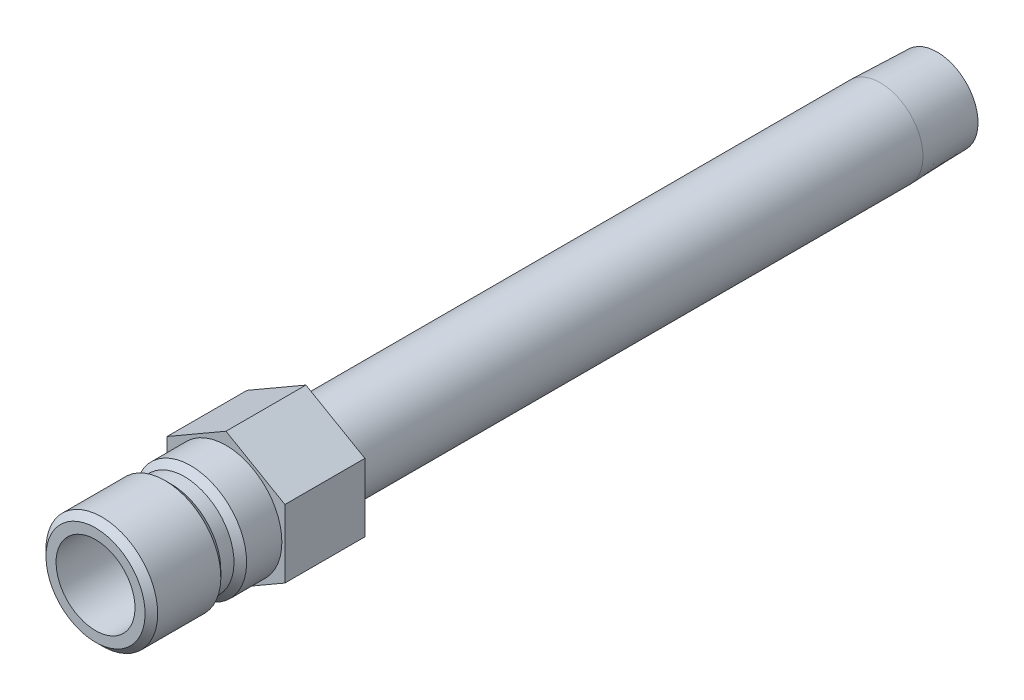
ISO-10303-21;
HEADER;
FILE_DESCRIPTION(('STEP AP214'),'2;1');
FILE_NAME('part.step','',(''),(''),'','','');
FILE_SCHEMA(('AUTOMOTIVE_DESIGN { 1 0 10303 214 1 1 1 1 }'));
ENDSEC;
DATA;
#1=APPLICATION_CONTEXT('core data for automotive mechanical design processes');
#2=APPLICATION_PROTOCOL_DEFINITION('international standard','automotive_design',2000,#1);
#3=PRODUCT_CONTEXT('',#1,'mechanical');
#4=PRODUCT('Part','Part','',(#3));
#5=PRODUCT_RELATED_PRODUCT_CATEGORY('part','',(#4));
#6=PRODUCT_DEFINITION_FORMATION('','',#4);
#7=PRODUCT_DEFINITION_CONTEXT('part definition',#1,'design');
#8=PRODUCT_DEFINITION('design','',#6,#7);
#9=PRODUCT_DEFINITION_SHAPE('','',#8);
#10=(LENGTH_UNIT() NAMED_UNIT(*) SI_UNIT(.MILLI.,.METRE.));
#11=(NAMED_UNIT(*) PLANE_ANGLE_UNIT() SI_UNIT($,.RADIAN.));
#12=(NAMED_UNIT(*) SI_UNIT($,.STERADIAN.) SOLID_ANGLE_UNIT());
#13=UNCERTAINTY_MEASURE_WITH_UNIT(LENGTH_MEASURE(1.E-05),#10,'distance_accuracy_value','');
#14=(GEOMETRIC_REPRESENTATION_CONTEXT(3) GLOBAL_UNCERTAINTY_ASSIGNED_CONTEXT((#13)) GLOBAL_UNIT_ASSIGNED_CONTEXT((#10,
#11,#12)) REPRESENTATION_CONTEXT('',''));
#15=CARTESIAN_POINT('',(0.,0.,0.));
#16=DIRECTION('',(0.,0.,1.));
#17=DIRECTION('',(1.,0.,0.));
#18=AXIS2_PLACEMENT_3D('',#15,#16,#17);
#19=CARTESIAN_POINT('',(0.,0.,-9.652));
#20=DIRECTION('',(0.,0.,-1.));
#21=DIRECTION('',(0.,1.,0.));
#22=AXIS2_PLACEMENT_3D('',#19,#20,#21);
#23=CYLINDRICAL_SURFACE('',#22,4.7625);
#24=CARTESIAN_POINT('',(0.,0.,3.556));
#25=DIRECTION('',(0.,0.,-1.));
#26=DIRECTION('',(0.,1.,0.));
#27=AXIS2_PLACEMENT_3D('',#24,#25,#26);
#28=CIRCLE('',#27,4.7625);
#29=CARTESIAN_POINT('',(0.,4.7625,3.556));
#30=VERTEX_POINT('',#29);
#31=EDGE_CURVE('E137',#30,#30,#28,.T.);
#32=ORIENTED_EDGE('',*,*,#31,.T.);
#33=EDGE_LOOP('',(#32));
#34=FACE_BOUND('',#33,.T.);
#35=CARTESIAN_POINT('',(0.,0.,15.748));
#36=DIRECTION('',(0.,0.,-1.));
#37=DIRECTION('',(0.,1.,0.));
#38=AXIS2_PLACEMENT_3D('',#35,#36,#37);
#39=CIRCLE('',#38,4.7625);
#40=CARTESIAN_POINT('',(0.,4.7625,15.748));
#41=VERTEX_POINT('',#40);
#42=EDGE_CURVE('E41',#41,#41,#39,.T.);
#43=ORIENTED_EDGE('',*,*,#42,.F.);
#44=EDGE_LOOP('',(#43));
#45=FACE_BOUND('',#44,.T.);
#46=ADVANCED_FACE('F33',(#34,#45),#23,.F.);
#47=CARTESIAN_POINT('',(0.,4.7625,15.748));
#48=DIRECTION('',(0.,0.,1.));
#49=DIRECTION('',(0.,-1.,0.));
#50=AXIS2_PLACEMENT_3D('',#47,#48,#49);
#51=PLANE('',#50);
#52=ORIENTED_EDGE('',*,*,#42,.T.);
#53=EDGE_LOOP('',(#52));
#54=FACE_BOUND('',#53,.T.);
#55=CARTESIAN_POINT('',(0.,0.,15.748));
#56=DIRECTION('',(0.,0.,-1.));
#57=DIRECTION('',(0.,1.,0.));
#58=AXIS2_PLACEMENT_3D('',#55,#56,#57);
#59=CIRCLE('',#58,5.9817);
#60=CARTESIAN_POINT('',(0.,5.9817,15.748));
#61=VERTEX_POINT('',#60);
#62=EDGE_CURVE('E175',#61,#61,#59,.T.);
#63=ORIENTED_EDGE('',*,*,#62,.F.);
#64=EDGE_LOOP('',(#63));
#65=FACE_BOUND('',#64,.T.);
#66=ADVANCED_FACE('F180',(#54,#65),#51,.T.);
#67=CARTESIAN_POINT('',(0.,0.,14.986));
#68=DIRECTION('',(0.,0.,-1.));
#69=DIRECTION('',(0.,1.,0.));
#70=AXIS2_PLACEMENT_3D('',#67,#68,#69);
#71=CONICAL_SURFACE('',#70,6.7437,0.785398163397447);
#72=ORIENTED_EDGE('',*,*,#62,.T.);
#73=EDGE_LOOP('',(#72));
#74=FACE_BOUND('',#73,.T.);
#75=CARTESIAN_POINT('',(0.,0.,14.986));
#76=DIRECTION('',(0.,0.,-1.));
#77=DIRECTION('',(0.,1.,0.));
#78=AXIS2_PLACEMENT_3D('',#75,#76,#77);
#79=CIRCLE('',#78,6.7437);
#80=CARTESIAN_POINT('',(0.,6.7437,14.986));
#81=VERTEX_POINT('',#80);
#82=EDGE_CURVE('E172',#81,#81,#79,.T.);
#83=ORIENTED_EDGE('',*,*,#82,.F.);
#84=EDGE_LOOP('',(#83));
#85=FACE_BOUND('',#84,.T.);
#86=ADVANCED_FACE('F188',(#74,#85),#71,.T.);
#87=CARTESIAN_POINT('',(0.,0.,-9.652));
#88=DIRECTION('',(0.,0.,-1.));
#89=DIRECTION('',(0.,1.,0.));
#90=AXIS2_PLACEMENT_3D('',#87,#88,#89);
#91=CYLINDRICAL_SURFACE('',#90,6.7437);
#92=ORIENTED_EDGE('',*,*,#82,.T.);
#93=EDGE_LOOP('',(#92));
#94=FACE_BOUND('',#93,.T.);
#95=CARTESIAN_POINT('',(0.,0.,7.366));
#96=DIRECTION('',(0.,0.,-1.));
#97=DIRECTION('',(0.,1.,0.));
#98=AXIS2_PLACEMENT_3D('',#95,#96,#97);
#99=CIRCLE('',#98,6.7437);
#100=CARTESIAN_POINT('',(0.,6.7437,7.366));
#101=VERTEX_POINT('',#100);
#102=EDGE_CURVE('E169',#101,#101,#99,.T.);
#103=ORIENTED_EDGE('',*,*,#102,.F.);
#104=EDGE_LOOP('',(#103));
#105=FACE_BOUND('',#104,.T.);
#106=ADVANCED_FACE('F237',(#94,#105),#91,.T.);
#107=CARTESIAN_POINT('',(0.,0.,6.604));
#108=DIRECTION('',(0.,0.,1.));
#109=DIRECTION('',(0.,-1.,0.));
#110=AXIS2_PLACEMENT_3D('',#107,#108,#109);
#111=CONICAL_SURFACE('',#110,5.9817,0.785398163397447);
#112=ORIENTED_EDGE('',*,*,#102,.T.);
#113=EDGE_LOOP('',(#112));
#114=FACE_BOUND('',#113,.T.);
#115=CARTESIAN_POINT('',(0.,0.,6.604));
#116=DIRECTION('',(0.,0.,-1.));
#117=DIRECTION('',(0.,1.,0.));
#118=AXIS2_PLACEMENT_3D('',#115,#116,#117);
#119=CIRCLE('',#118,5.9817);
#120=CARTESIAN_POINT('',(0.,5.9817,6.604));
#121=VERTEX_POINT('',#120);
#122=EDGE_CURVE('E166',#121,#121,#119,.T.);
#123=ORIENTED_EDGE('',*,*,#122,.F.);
#124=EDGE_LOOP('',(#123));
#125=FACE_BOUND('',#124,.T.);
#126=ADVANCED_FACE('F233',(#114,#125),#111,.T.);
#127=CARTESIAN_POINT('',(0.,0.,-9.652));
#128=DIRECTION('',(0.,0.,-1.));
#129=DIRECTION('',(0.,1.,0.));
#130=AXIS2_PLACEMENT_3D('',#127,#128,#129);
#131=CYLINDRICAL_SURFACE('',#130,5.9817);
#132=ORIENTED_EDGE('',*,*,#122,.T.);
#133=EDGE_LOOP('',(#132));
#134=FACE_BOUND('',#133,.T.);
#135=CARTESIAN_POINT('',(0.,0.,5.0165));
#136=DIRECTION('',(0.,0.,-1.));
#137=DIRECTION('',(0.,1.,0.));
#138=AXIS2_PLACEMENT_3D('',#135,#136,#137);
#139=CIRCLE('',#138,5.9817);
#140=CARTESIAN_POINT('',(0.,5.9817,5.0165));
#141=VERTEX_POINT('',#140);
#142=EDGE_CURVE('E163',#141,#141,#139,.T.);
#143=ORIENTED_EDGE('',*,*,#142,.F.);
#144=EDGE_LOOP('',(#143));
#145=FACE_BOUND('',#144,.T.);
#146=ADVANCED_FACE('F229',(#134,#145),#131,.T.);
#147=CARTESIAN_POINT('',(0.,0.,4.2545));
#148=DIRECTION('',(0.,0.,-1.));
#149=DIRECTION('',(0.,1.,0.));
#150=AXIS2_PLACEMENT_3D('',#147,#148,#149);
#151=CONICAL_SURFACE('',#150,6.7437,0.785398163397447);
#152=ORIENTED_EDGE('',*,*,#142,.T.);
#153=EDGE_LOOP('',(#152));
#154=FACE_BOUND('',#153,.T.);
#155=CARTESIAN_POINT('',(0.,0.,4.2545));
#156=DIRECTION('',(0.,0.,-1.));
#157=DIRECTION('',(0.,1.,0.));
#158=AXIS2_PLACEMENT_3D('',#155,#156,#157);
#159=CIRCLE('',#158,6.7437);
#160=CARTESIAN_POINT('',(0.,6.7437,4.2545));
#161=VERTEX_POINT('',#160);
#162=EDGE_CURVE('E160',#161,#161,#159,.T.);
#163=ORIENTED_EDGE('',*,*,#162,.F.);
#164=EDGE_LOOP('',(#163));
#165=FACE_BOUND('',#164,.T.);
#166=ADVANCED_FACE('F225',(#154,#165),#151,.T.);
#167=CARTESIAN_POINT('',(0.,0.,-9.652));
#168=DIRECTION('',(0.,0.,-1.));
#169=DIRECTION('',(0.,1.,0.));
#170=AXIS2_PLACEMENT_3D('',#167,#168,#169);
#171=CYLINDRICAL_SURFACE('',#170,6.7437);
#172=CARTESIAN_POINT('',(0.,0.,0.));
#173=DIRECTION('',(0.,0.,1.));
#174=DIRECTION('',(1.,0.,0.));
#175=AXIS2_PLACEMENT_3D('',#172,#173,#174);
#176=CIRCLE('',#175,6.7437);
#177=CARTESIAN_POINT('',(6.7437,0.,0.));
#178=VERTEX_POINT('',#177);
#179=EDGE_CURVE('E11',#178,#178,#176,.F.);
#180=ORIENTED_EDGE('',*,*,#179,.F.);
#181=EDGE_LOOP('',(#180));
#182=FACE_BOUND('',#181,.T.);
#183=ORIENTED_EDGE('',*,*,#162,.T.);
#184=EDGE_LOOP('',(#183));
#185=FACE_BOUND('',#184,.T.);
#186=ADVANCED_FACE('F221',(#182,#185),#171,.T.);
#187=CARTESIAN_POINT('',(0.,6.7437,-9.652));
#188=DIRECTION('',(0.,0.,-1.));
#189=DIRECTION('',(0.,1.,0.));
#190=AXIS2_PLACEMENT_3D('',#187,#188,#189);
#191=PLANE('',#190);
#192=CARTESIAN_POINT('',(0.,0.,-9.652));
#193=DIRECTION('',(0.,0.,-1.));
#194=DIRECTION('',(0.,1.,0.));
#195=AXIS2_PLACEMENT_3D('',#192,#193,#194);
#196=CIRCLE('',#195,5.1435);
#197=CARTESIAN_POINT('',(0.,5.1435,-9.652));
#198=VERTEX_POINT('',#197);
#199=EDGE_CURVE('E157',#198,#198,#196,.T.);
#200=ORIENTED_EDGE('',*,*,#199,.F.);
#201=EDGE_LOOP('',(#200));
#202=FACE_BOUND('',#201,.T.);
#203=DIRECTION('',(-0.866025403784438,-0.5,0.));
#204=VECTOR('',#203,1.);
#205=CARTESIAN_POINT('',(0.,8.21223022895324,-9.652));
#206=LINE('',#205,#204);
#207=CARTESIAN_POINT('',(0.,8.21223022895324,-9.652));
#208=VERTEX_POINT('',#207);
#209=CARTESIAN_POINT('',(-7.112,4.10611511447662,-9.652));
#210=VERTEX_POINT('',#209);
#211=EDGE_CURVE('E135',#208,#210,#206,.T.);
#212=ORIENTED_EDGE('',*,*,#211,.F.);
#213=DIRECTION('',(-0.866025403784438,0.5,0.));
#214=VECTOR('',#213,1.);
#215=CARTESIAN_POINT('',(7.112,4.10611511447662,-9.652));
#216=LINE('',#215,#214);
#217=CARTESIAN_POINT('',(7.112,4.10611511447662,-9.652));
#218=VERTEX_POINT('',#217);
#219=EDGE_CURVE('E110',#218,#208,#216,.T.);
#220=ORIENTED_EDGE('',*,*,#219,.F.);
#221=DIRECTION('',(0.,1.,0.));
#222=VECTOR('',#221,1.);
#223=CARTESIAN_POINT('',(7.112,-4.10611511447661,-9.652));
#224=LINE('',#223,#222);
#225=CARTESIAN_POINT('',(7.112,-4.10611511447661,-9.652));
#226=VERTEX_POINT('',#225);
#227=EDGE_CURVE('E95',#226,#218,#224,.T.);
#228=ORIENTED_EDGE('',*,*,#227,.F.);
#229=DIRECTION('',(0.866025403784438,0.5,0.));
#230=VECTOR('',#229,1.);
#231=CARTESIAN_POINT('',(0.,-8.21223022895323,-9.652));
#232=LINE('',#231,#230);
#233=CARTESIAN_POINT('',(0.,-8.21223022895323,-9.652));
#234=VERTEX_POINT('',#233);
#235=EDGE_CURVE('E108',#234,#226,#232,.T.);
#236=ORIENTED_EDGE('',*,*,#235,.F.);
#237=DIRECTION('',(0.866025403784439,-0.5,0.));
#238=VECTOR('',#237,1.);
#239=CARTESIAN_POINT('',(-7.112,-4.10611511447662,-9.652));
#240=LINE('',#239,#238);
#241=CARTESIAN_POINT('',(-7.112,-4.10611511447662,-9.652));
#242=VERTEX_POINT('',#241);
#243=EDGE_CURVE('E113',#242,#234,#240,.T.);
#244=ORIENTED_EDGE('',*,*,#243,.F.);
#245=DIRECTION('',(0.,-1.,0.));
#246=VECTOR('',#245,1.);
#247=CARTESIAN_POINT('',(-7.112,4.10611511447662,-9.652));
#248=LINE('',#247,#246);
#249=EDGE_CURVE('E115',#210,#242,#248,.T.);
#250=ORIENTED_EDGE('',*,*,#249,.F.);
#251=EDGE_LOOP('',(#212,#220,#228,#236,#244,#250));
#252=FACE_BOUND('',#251,.T.);
#253=ADVANCED_FACE('F106',(#202,#252),#191,.T.);
#254=CARTESIAN_POINT('',(0.,0.,-9.652));
#255=DIRECTION('',(0.,0.,-1.));
#256=DIRECTION('',(0.,1.,0.));
#257=AXIS2_PLACEMENT_3D('',#254,#255,#256);
#258=CYLINDRICAL_SURFACE('',#257,5.1435);
#259=ORIENTED_EDGE('',*,*,#199,.T.);
#260=EDGE_LOOP('',(#259));
#261=FACE_BOUND('',#260,.T.);
#262=CARTESIAN_POINT('',(0.,0.,-78.994));
#263=DIRECTION('',(0.,0.,-1.));
#264=DIRECTION('',(0.,1.,0.));
#265=AXIS2_PLACEMENT_3D('',#262,#263,#264);
#266=CIRCLE('',#265,5.1435);
#267=CARTESIAN_POINT('',(0.,5.1435,-78.994));
#268=VERTEX_POINT('',#267);
#269=EDGE_CURVE('E154',#268,#268,#266,.T.);
#270=ORIENTED_EDGE('',*,*,#269,.F.);
#271=EDGE_LOOP('',(#270));
#272=FACE_BOUND('',#271,.T.);
#273=ADVANCED_FACE('F214',(#261,#272),#258,.T.);
#274=CARTESIAN_POINT('',(0.,0.,-85.852));
#275=DIRECTION('',(0.,0.,1.));
#276=DIRECTION('',(0.,-1.,0.));
#277=AXIS2_PLACEMENT_3D('',#274,#275,#276);
#278=CONICAL_SURFACE('',#277,4.9291887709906,0.0312396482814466);
#279=ORIENTED_EDGE('',*,*,#269,.T.);
#280=EDGE_LOOP('',(#279));
#281=FACE_BOUND('',#280,.T.);
#282=CARTESIAN_POINT('',(0.,0.,-85.852));
#283=DIRECTION('',(0.,0.,-1.));
#284=DIRECTION('',(0.,1.,0.));
#285=AXIS2_PLACEMENT_3D('',#282,#283,#284);
#286=CIRCLE('',#285,4.9291887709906);
#287=CARTESIAN_POINT('',(0.,4.9291887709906,-85.852));
#288=VERTEX_POINT('',#287);
#289=EDGE_CURVE('E151',#288,#288,#286,.T.);
#290=ORIENTED_EDGE('',*,*,#289,.F.);
#291=EDGE_LOOP('',(#290));
#292=FACE_BOUND('',#291,.T.);
#293=ADVANCED_FACE('F210',(#281,#292),#278,.T.);
#294=CARTESIAN_POINT('',(0.,4.9291887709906,-85.852));
#295=DIRECTION('',(0.,0.,-1.));
#296=DIRECTION('',(0.,1.,0.));
#297=AXIS2_PLACEMENT_3D('',#294,#295,#296);
#298=PLANE('',#297);
#299=ORIENTED_EDGE('',*,*,#289,.T.);
#300=EDGE_LOOP('',(#299));
#301=FACE_BOUND('',#300,.T.);
#302=CARTESIAN_POINT('',(0.,0.,-85.852));
#303=DIRECTION('',(0.,0.,-1.));
#304=DIRECTION('',(0.,1.,0.));
#305=AXIS2_PLACEMENT_3D('',#302,#303,#304);
#306=CIRCLE('',#305,3.41629999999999);
#307=CARTESIAN_POINT('',(0.,3.4163,-85.852));
#308=VERTEX_POINT('',#307);
#309=EDGE_CURVE('E148',#308,#308,#306,.T.);
#310=ORIENTED_EDGE('',*,*,#309,.F.);
#311=EDGE_LOOP('',(#310));
#312=FACE_BOUND('',#311,.T.);
#313=ADVANCED_FACE('F203',(#301,#312),#298,.T.);
#314=CARTESIAN_POINT('',(0.,0.,-9.652));
#315=DIRECTION('',(0.,0.,-1.));
#316=DIRECTION('',(0.,1.,0.));
#317=AXIS2_PLACEMENT_3D('',#314,#315,#316);
#318=CYLINDRICAL_SURFACE('',#317,3.4163);
#319=ORIENTED_EDGE('',*,*,#309,.T.);
#320=EDGE_LOOP('',(#319));
#321=FACE_BOUND('',#320,.T.);
#322=CARTESIAN_POINT('',(0.,0.,2.84021276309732));
#323=DIRECTION('',(0.,0.,-1.));
#324=DIRECTION('',(0.,1.,0.));
#325=AXIS2_PLACEMENT_3D('',#322,#323,#324);
#326=CIRCLE('',#325,3.4163);
#327=CARTESIAN_POINT('',(0.,3.4163,2.84021276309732));
#328=VERTEX_POINT('',#327);
#329=EDGE_CURVE('E145',#328,#328,#326,.T.);
#330=ORIENTED_EDGE('',*,*,#329,.F.);
#331=EDGE_LOOP('',(#330));
#332=FACE_BOUND('',#331,.T.);
#333=ADVANCED_FACE('F194',(#321,#332),#318,.F.);
#334=CARTESIAN_POINT('',(0.,0.,3.556));
#335=DIRECTION('',(0.,0.,1.));
#336=DIRECTION('',(0.,-1.,0.));
#337=AXIS2_PLACEMENT_3D('',#334,#335,#336);
#338=CONICAL_SURFACE('',#337,4.7625,1.08210413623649);
#339=ORIENTED_EDGE('',*,*,#329,.T.);
#340=EDGE_LOOP('',(#339));
#341=FACE_BOUND('',#340,.T.);
#342=ORIENTED_EDGE('',*,*,#31,.F.);
#343=EDGE_LOOP('',(#342));
#344=FACE_BOUND('',#343,.T.);
#345=ADVANCED_FACE('F191',(#341,#344),#338,.F.);
#346=CARTESIAN_POINT('',(0.,8.21223022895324,-9.652));
#347=DIRECTION('',(-0.5,0.866025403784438,0.));
#348=DIRECTION('',(-0.866025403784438,-0.5,0.));
#349=AXIS2_PLACEMENT_3D('',#346,#347,#348);
#350=PLANE('',#349);
#351=DIRECTION('',(-0.866025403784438,-0.5,0.));
#352=VECTOR('',#351,1.);
#353=CARTESIAN_POINT('',(0.,8.21223022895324,0.));
#354=LINE('',#353,#352);
#355=CARTESIAN_POINT('',(0.,8.21223022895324,0.));
#356=VERTEX_POINT('',#355);
#357=CARTESIAN_POINT('',(-7.112,4.10611511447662,0.));
#358=VERTEX_POINT('',#357);
#359=EDGE_CURVE('E120',#356,#358,#354,.T.);
#360=ORIENTED_EDGE('',*,*,#359,.F.);
#361=DIRECTION('',(0.,0.,1.));
#362=VECTOR('',#361,1.);
#363=CARTESIAN_POINT('',(0.,8.21223022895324,-9.652));
#364=LINE('',#363,#362);
#365=EDGE_CURVE('E49',#208,#356,#364,.T.);
#366=ORIENTED_EDGE('',*,*,#365,.F.);
#367=ORIENTED_EDGE('',*,*,#211,.T.);
#368=DIRECTION('',(0.,0.,1.));
#369=VECTOR('',#368,1.);
#370=CARTESIAN_POINT('',(-7.112,4.10611511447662,-9.652));
#371=LINE('',#370,#369);
#372=EDGE_CURVE('E84',#210,#358,#371,.T.);
#373=ORIENTED_EDGE('',*,*,#372,.T.);
#374=EDGE_LOOP('',(#360,#366,#367,#373));
#375=FACE_BOUND('',#374,.T.);
#376=ADVANCED_FACE('F193',(#375),#350,.T.);
#377=CARTESIAN_POINT('',(7.112,4.10611511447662,-9.652));
#378=DIRECTION('',(0.5,0.866025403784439,0.));
#379=DIRECTION('',(-0.866025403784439,0.5,0.));
#380=AXIS2_PLACEMENT_3D('',#377,#378,#379);
#381=PLANE('',#380);
#382=DIRECTION('',(-0.866025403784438,0.5,0.));
#383=VECTOR('',#382,1.);
#384=CARTESIAN_POINT('',(7.112,4.10611511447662,0.));
#385=LINE('',#384,#383);
#386=CARTESIAN_POINT('',(7.112,4.10611511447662,0.));
#387=VERTEX_POINT('',#386);
#388=EDGE_CURVE('E132',#387,#356,#385,.T.);
#389=ORIENTED_EDGE('',*,*,#388,.F.);
#390=DIRECTION('',(0.,0.,1.));
#391=VECTOR('',#390,1.);
#392=CARTESIAN_POINT('',(7.112,4.10611511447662,-9.652));
#393=LINE('',#392,#391);
#394=EDGE_CURVE('E72',#218,#387,#393,.T.);
#395=ORIENTED_EDGE('',*,*,#394,.F.);
#396=ORIENTED_EDGE('',*,*,#219,.T.);
#397=ORIENTED_EDGE('',*,*,#365,.T.);
#398=EDGE_LOOP('',(#389,#395,#396,#397));
#399=FACE_BOUND('',#398,.T.);
#400=ADVANCED_FACE('F201',(#399),#381,.T.);
#401=CARTESIAN_POINT('',(7.112,-4.10611511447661,-9.652));
#402=DIRECTION('',(1.,0.,0.));
#403=DIRECTION('',(0.,1.,0.));
#404=AXIS2_PLACEMENT_3D('',#401,#402,#403);
#405=PLANE('',#404);
#406=DIRECTION('',(0.,1.,0.));
#407=VECTOR('',#406,1.);
#408=CARTESIAN_POINT('',(7.112,-4.10611511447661,0.));
#409=LINE('',#408,#407);
#410=CARTESIAN_POINT('',(7.112,-4.10611511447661,0.));
#411=VERTEX_POINT('',#410);
#412=EDGE_CURVE('E97',#411,#387,#409,.T.);
#413=ORIENTED_EDGE('',*,*,#412,.F.);
#414=DIRECTION('',(0.,0.,1.));
#415=VECTOR('',#414,1.);
#416=CARTESIAN_POINT('',(7.112,-4.10611511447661,-9.652));
#417=LINE('',#416,#415);
#418=EDGE_CURVE('E92',#226,#411,#417,.T.);
#419=ORIENTED_EDGE('',*,*,#418,.F.);
#420=ORIENTED_EDGE('',*,*,#227,.T.);
#421=ORIENTED_EDGE('',*,*,#394,.T.);
#422=EDGE_LOOP('',(#413,#419,#420,#421));
#423=FACE_BOUND('',#422,.T.);
#424=ADVANCED_FACE('F94',(#423),#405,.T.);
#425=CARTESIAN_POINT('',(0.,-8.21223022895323,-9.652));
#426=DIRECTION('',(0.5,-0.866025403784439,0.));
#427=DIRECTION('',(0.866025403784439,0.5,0.));
#428=AXIS2_PLACEMENT_3D('',#425,#426,#427);
#429=PLANE('',#428);
#430=DIRECTION('',(0.866025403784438,0.5,0.));
#431=VECTOR('',#430,1.);
#432=CARTESIAN_POINT('',(0.,-8.21223022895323,0.));
#433=LINE('',#432,#431);
#434=CARTESIAN_POINT('',(0.,-8.21223022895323,0.));
#435=VERTEX_POINT('',#434);
#436=EDGE_CURVE('E129',#435,#411,#433,.T.);
#437=ORIENTED_EDGE('',*,*,#436,.F.);
#438=DIRECTION('',(0.,0.,1.));
#439=VECTOR('',#438,1.);
#440=CARTESIAN_POINT('',(0.,-8.21223022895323,-9.652));
#441=LINE('',#440,#439);
#442=EDGE_CURVE('E102',#234,#435,#441,.T.);
#443=ORIENTED_EDGE('',*,*,#442,.F.);
#444=ORIENTED_EDGE('',*,*,#235,.T.);
#445=ORIENTED_EDGE('',*,*,#418,.T.);
#446=EDGE_LOOP('',(#437,#443,#444,#445));
#447=FACE_BOUND('',#446,.T.);
#448=ADVANCED_FACE('F112',(#447),#429,.T.);
#449=CARTESIAN_POINT('',(-7.112,-4.10611511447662,-9.652));
#450=DIRECTION('',(-0.5,-0.866025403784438,0.));
#451=DIRECTION('',(0.866025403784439,-0.5,0.));
#452=AXIS2_PLACEMENT_3D('',#449,#450,#451);
#453=PLANE('',#452);
#454=DIRECTION('',(0.866025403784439,-0.5,0.));
#455=VECTOR('',#454,1.);
#456=CARTESIAN_POINT('',(-7.112,-4.10611511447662,0.));
#457=LINE('',#456,#455);
#458=CARTESIAN_POINT('',(-7.112,-4.10611511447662,0.));
#459=VERTEX_POINT('',#458);
#460=EDGE_CURVE('E126',#459,#435,#457,.T.);
#461=ORIENTED_EDGE('',*,*,#460,.F.);
#462=DIRECTION('',(0.,0.,1.));
#463=VECTOR('',#462,1.);
#464=CARTESIAN_POINT('',(-7.112,-4.10611511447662,-9.652));
#465=LINE('',#464,#463);
#466=EDGE_CURVE('E140',#242,#459,#465,.T.);
#467=ORIENTED_EDGE('',*,*,#466,.F.);
#468=ORIENTED_EDGE('',*,*,#243,.T.);
#469=ORIENTED_EDGE('',*,*,#442,.T.);
#470=EDGE_LOOP('',(#461,#467,#468,#469));
#471=FACE_BOUND('',#470,.T.);
#472=ADVANCED_FACE('F338',(#471),#453,.T.);
#473=CARTESIAN_POINT('',(-7.112,4.10611511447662,-9.652));
#474=DIRECTION('',(-1.,0.,0.));
#475=DIRECTION('',(0.,-1.,0.));
#476=AXIS2_PLACEMENT_3D('',#473,#474,#475);
#477=PLANE('',#476);
#478=DIRECTION('',(0.,-1.,0.));
#479=VECTOR('',#478,1.);
#480=CARTESIAN_POINT('',(-7.112,4.10611511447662,0.));
#481=LINE('',#480,#479);
#482=EDGE_CURVE('E123',#358,#459,#481,.T.);
#483=ORIENTED_EDGE('',*,*,#482,.F.);
#484=ORIENTED_EDGE('',*,*,#372,.F.);
#485=ORIENTED_EDGE('',*,*,#249,.T.);
#486=ORIENTED_EDGE('',*,*,#466,.T.);
#487=EDGE_LOOP('',(#483,#484,#485,#486));
#488=FACE_BOUND('',#487,.T.);
#489=ADVANCED_FACE('F346',(#488),#477,.T.);
#490=CARTESIAN_POINT('',(-7.112,4.10611511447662,0.));
#491=DIRECTION('',(0.,0.,1.));
#492=DIRECTION('',(1.,0.,0.));
#493=AXIS2_PLACEMENT_3D('',#490,#491,#492);
#494=PLANE('',#493);
#495=ORIENTED_EDGE('',*,*,#179,.T.);
#496=EDGE_LOOP('',(#495));
#497=FACE_BOUND('',#496,.T.);
#498=ORIENTED_EDGE('',*,*,#359,.T.);
#499=ORIENTED_EDGE('',*,*,#482,.T.);
#500=ORIENTED_EDGE('',*,*,#460,.T.);
#501=ORIENTED_EDGE('',*,*,#436,.T.);
#502=ORIENTED_EDGE('',*,*,#412,.T.);
#503=ORIENTED_EDGE('',*,*,#388,.T.);
#504=EDGE_LOOP('',(#498,#499,#500,#501,#502,#503));
#505=FACE_BOUND('',#504,.T.);
#506=ADVANCED_FACE('F355',(#497,#505),#494,.T.);
#507=CLOSED_SHELL('',(#46,#66,#86,#106,#126,#146,#166,#186,#253,#273,#293,#313,#333,#345,#376,
#400,#424,#448,#472,#489,#506));
#508=MANIFOLD_SOLID_BREP('B2',#507);
#509=ADVANCED_BREP_SHAPE_REPRESENTATION('',(#18,#508),#14);
#510=SHAPE_DEFINITION_REPRESENTATION(#9,#509);
ENDSEC;
END-ISO-10303-21;
